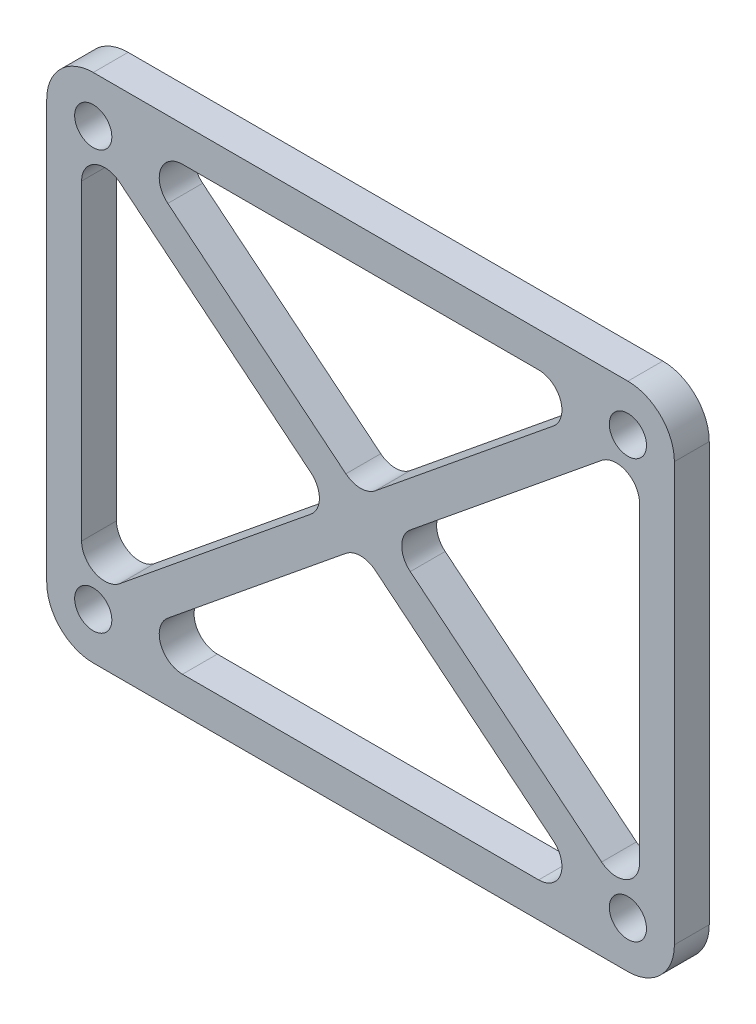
from build123d import *

# Parameters (mm, degrees)
SKETCH_1_W          = 54
SKETCH_1_H          = 44
SKETCH_1_R          = 1.6
EXTRUDE_1_DEPTH     = 3
CUT_EXTRUDE_1_DEPTH = 3
CUT_EXTRUDE_2_DEPTH = 3
FILLET_3_R          = 4


with BuildPart() as part:
    # Sketch 1 → Extrude 1 (new body)
    with BuildSketch(Plane.XY):
        Rectangle(SKETCH_1_W, SKETCH_1_H)
        with Locations((-23, 18)):
            Circle(SKETCH_1_R, mode=Mode.SUBTRACT)
        with Locations((23, 18)):
            Circle(SKETCH_1_R, mode=Mode.SUBTRACT)
        with Locations((23, -18)):
            Circle(SKETCH_1_R, mode=Mode.SUBTRACT)
        with Locations((-23, -18)):
            Circle(SKETCH_1_R, mode=Mode.SUBTRACT)
    extrude(amount=EXTRUDE_1_DEPTH)

    # Sketch 2 → Cut-Extrude 1 (cut)
    with BuildSketch(Plane.XY.offset(3)):
        with BuildLine():
            Line((-16.586140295, 15.449530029), (-1.263345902, 2.964290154))
            ThreePointArc((-1.263345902, 2.964290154), (0, 2.514760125), (1.263345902, 2.964290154))
            Line((1.263345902, 2.964290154), (16.586140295, 15.449530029))
            ThreePointArc((16.586140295, 15.449530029), (17.207063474, 17.670470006), (15.322794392, 19))
            Line((15.322794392, 19), (-15.322794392, 19))
            ThreePointArc((-15.322794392, 19), (-17.207063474, 17.670470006), (-16.586140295, 15.449530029))
        make_face()
    cut_extrude_1 = extrude(amount=-CUT_EXTRUDE_1_DEPTH, mode=Mode.SUBTRACT)

    # Sketch 2_3 → Cut-Extrude 2 (cut)
    with BuildSketch(Plane.XY.offset(3)):
        with BuildLine():
            Line((-16.586140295, 15.449530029), (-1.263345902, 2.964290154))
            ThreePointArc((-1.263345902, 2.964290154), (0, 2.514760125), (1.263345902, 2.964290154))
            Line((1.263345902, 2.964290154), (16.586140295, 15.449530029))
            ThreePointArc((16.586140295, 15.449530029), (17.207063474, 17.670470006), (15.322794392, 19))
            Line((15.322794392, 19), (-15.322794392, 19))
            ThreePointArc((-15.322794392, 19), (-17.207063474, 17.670470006), (-16.586140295, 15.449530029))
        make_face()
        with BuildLine():
            Line((-24, 13.411165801), (-24, -13.411165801))
            ThreePointArc((-24, -13.411165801), (-22.858285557, -15.217639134), (-20.736654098, -14.961635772))
            Line((-20.736654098, -14.961635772), (-4.277496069, -1.550469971))
            ThreePointArc((-4.277496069, -1.550469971), (-3.540841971, 0), (-4.277496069, 1.550469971))
            Line((-4.277496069, 1.550469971), (-20.736654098, 14.961635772))
            ThreePointArc((-20.736654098, 14.961635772), (-22.858285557, 15.217639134), (-24, 13.411165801))
        make_face()
    cut_extrude_2 = extrude(amount=-CUT_EXTRUDE_2_DEPTH, mode=Mode.SUBTRACT)

    # Mirror 3: Cut-Extrude 1 across plane
    add(cut_extrude_1.mirror(Plane.ZX), mode=Mode.SUBTRACT)

    # Mirror 4: Cut-Extrude 2 across plane
    add(cut_extrude_2.mirror(Plane(origin=(0, 0, 0), x_dir=(0, 0, 1), z_dir=(1, 0, 0))), mode=Mode.SUBTRACT)

    # Fillet 3
    fillet_3_edges = [part.edges().sort_by_distance(p)[0] for p in [
        (27, -22, 1.5),
        (-27, -22, 1.5),
        (-27, 22, 1.5),
        (27, 22, 1.5),
    ]]
    fillet(fillet_3_edges, radius=FILLET_3_R)


solid = part.part
